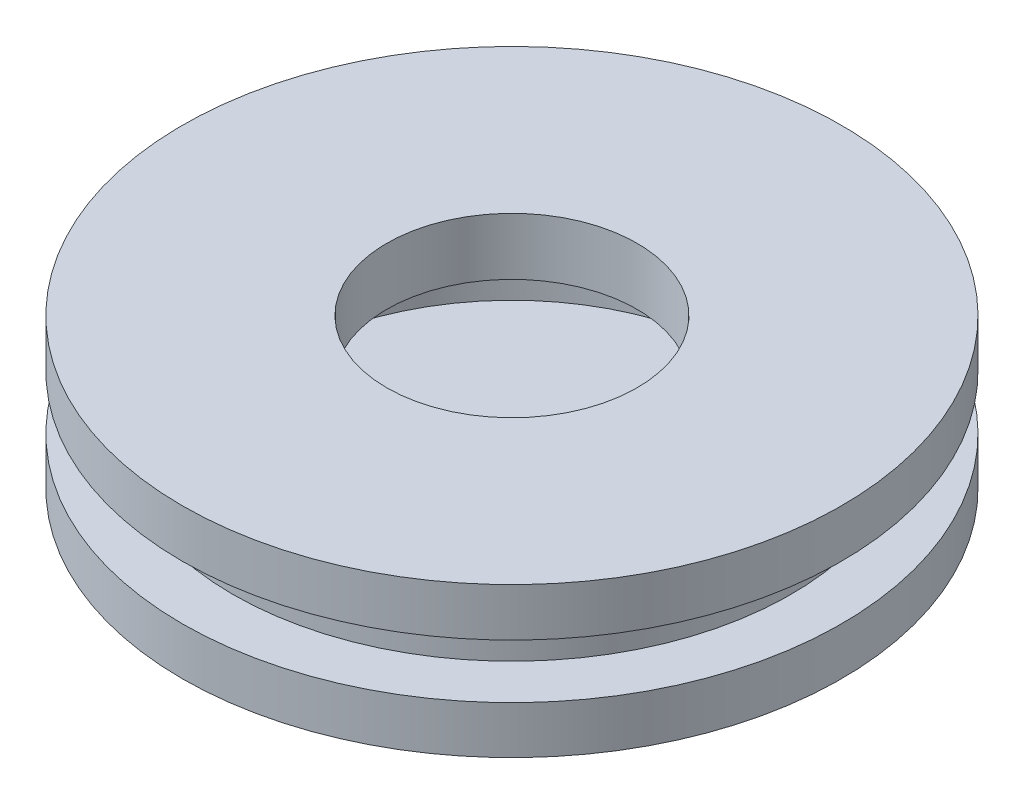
ISO-10303-21;
HEADER;
FILE_DESCRIPTION(('STEP AP214'),'2;1');
FILE_NAME('part.step','',(''),(''),'','','');
FILE_SCHEMA(('AUTOMOTIVE_DESIGN { 1 0 10303 214 1 1 1 1 }'));
ENDSEC;
DATA;
#1=APPLICATION_CONTEXT('core data for automotive mechanical design processes');
#2=APPLICATION_PROTOCOL_DEFINITION('international standard','automotive_design',2000,#1);
#3=PRODUCT_CONTEXT('',#1,'mechanical');
#4=PRODUCT('Part','Part','',(#3));
#5=PRODUCT_RELATED_PRODUCT_CATEGORY('part','',(#4));
#6=PRODUCT_DEFINITION_FORMATION('','',#4);
#7=PRODUCT_DEFINITION_CONTEXT('part definition',#1,'design');
#8=PRODUCT_DEFINITION('design','',#6,#7);
#9=PRODUCT_DEFINITION_SHAPE('','',#8);
#10=(LENGTH_UNIT() NAMED_UNIT(*) SI_UNIT(.MILLI.,.METRE.));
#11=(NAMED_UNIT(*) PLANE_ANGLE_UNIT() SI_UNIT($,.RADIAN.));
#12=(NAMED_UNIT(*) SI_UNIT($,.STERADIAN.) SOLID_ANGLE_UNIT());
#13=UNCERTAINTY_MEASURE_WITH_UNIT(LENGTH_MEASURE(1.E-05),#10,'distance_accuracy_value','');
#14=(GEOMETRIC_REPRESENTATION_CONTEXT(3) GLOBAL_UNCERTAINTY_ASSIGNED_CONTEXT((#13)) GLOBAL_UNIT_ASSIGNED_CONTEXT((#10,
#11,#12)) REPRESENTATION_CONTEXT('',''));
#15=CARTESIAN_POINT('',(0.,0.,0.));
#16=DIRECTION('',(0.,0.,1.));
#17=DIRECTION('',(1.,0.,0.));
#18=AXIS2_PLACEMENT_3D('',#15,#16,#17);
#19=CARTESIAN_POINT('',(0.,-2.95538243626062,0.));
#20=DIRECTION('',(0.,1.,0.));
#21=DIRECTION('',(0.,0.,1.));
#22=AXIS2_PLACEMENT_3D('',#19,#20,#21);
#23=CONICAL_SURFACE('',#22,6.5,1.36415687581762);
#24=CARTESIAN_POINT('',(0.,-4.31798866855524,0.));
#25=VERTEX_POINT('',#24);
#26=VERTEX_LOOP('',#25);
#27=FACE_BOUND('',#26,.T.);
#28=CARTESIAN_POINT('',(0.,-2.95538243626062,0.));
#29=DIRECTION('',(0.,1.,0.));
#30=DIRECTION('',(0.,0.,1.));
#31=AXIS2_PLACEMENT_3D('',#28,#29,#30);
#32=CIRCLE('',#31,6.5);
#33=CARTESIAN_POINT('',(0.,-2.95538243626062,6.5));
#34=VERTEX_POINT('',#33);
#35=EDGE_CURVE('E51',#34,#34,#32,.T.);
#36=ORIENTED_EDGE('',*,*,#35,.F.);
#37=EDGE_LOOP('',(#36));
#38=FACE_BOUND('',#37,.T.);
#39=ADVANCED_FACE('F36',(#27,#38),#23,.T.);
#40=CARTESIAN_POINT('',(0.,0.,0.));
#41=DIRECTION('',(0.,1.,0.));
#42=DIRECTION('',(0.,0.,1.));
#43=AXIS2_PLACEMENT_3D('',#40,#41,#42);
#44=PLANE('',#43);
#45=CARTESIAN_POINT('',(0.,0.,0.));
#46=DIRECTION('',(0.,1.,0.));
#47=DIRECTION('',(0.,0.,1.));
#48=AXIS2_PLACEMENT_3D('',#45,#46,#47);
#49=CIRCLE('',#48,2.46928204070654);
#50=CARTESIAN_POINT('',(0.,0.,2.46928204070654));
#51=VERTEX_POINT('',#50);
#52=EDGE_CURVE('E39',#51,#51,#49,.T.);
#53=ORIENTED_EDGE('',*,*,#52,.F.);
#54=EDGE_LOOP('',(#53));
#55=FACE_BOUND('',#54,.T.);
#56=CARTESIAN_POINT('',(0.,0.,0.));
#57=DIRECTION('',(0.,1.,0.));
#58=DIRECTION('',(0.,0.,1.));
#59=AXIS2_PLACEMENT_3D('',#56,#57,#58);
#60=CIRCLE('',#59,6.5);
#61=CARTESIAN_POINT('',(0.,0.,6.5));
#62=VERTEX_POINT('',#61);
#63=EDGE_CURVE('E11',#62,#62,#60,.T.);
#64=ORIENTED_EDGE('',*,*,#63,.T.);
#65=EDGE_LOOP('',(#64));
#66=FACE_BOUND('',#65,.T.);
#67=ADVANCED_FACE('F48',(#55,#66),#44,.T.);
#68=CARTESIAN_POINT('',(0.,-4.31798866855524,0.));
#69=DIRECTION('',(0.,1.,0.));
#70=DIRECTION('',(0.,0.,1.));
#71=AXIS2_PLACEMENT_3D('',#68,#69,#70);
#72=CYLINDRICAL_SURFACE('',#71,6.5);
#73=CARTESIAN_POINT('',(0.,-0.948300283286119,0.));
#74=DIRECTION('',(0.,1.,0.));
#75=DIRECTION('',(0.,0.,1.));
#76=AXIS2_PLACEMENT_3D('',#73,#74,#75);
#77=CIRCLE('',#76,6.5);
#78=CARTESIAN_POINT('',(0.,-0.948300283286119,6.5));
#79=VERTEX_POINT('',#78);
#80=EDGE_CURVE('E43',#79,#79,#77,.T.);
#81=ORIENTED_EDGE('',*,*,#80,.T.);
#82=EDGE_LOOP('',(#81));
#83=FACE_BOUND('',#82,.T.);
#84=ORIENTED_EDGE('',*,*,#63,.F.);
#85=EDGE_LOOP('',(#84));
#86=FACE_BOUND('',#85,.T.);
#87=ADVANCED_FACE('F71',(#83,#86),#72,.T.);
#88=CARTESIAN_POINT('',(-6.5,-0.94830028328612,0.));
#89=DIRECTION('',(0.,-1.,0.));
#90=DIRECTION('',(0.,0.,-1.));
#91=AXIS2_PLACEMENT_3D('',#88,#89,#90);
#92=PLANE('',#91);
#93=CARTESIAN_POINT('',(0.,-0.94830028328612,0.));
#94=DIRECTION('',(0.,1.,0.));
#95=DIRECTION('',(0.,0.,1.));
#96=AXIS2_PLACEMENT_3D('',#93,#94,#95);
#97=CIRCLE('',#96,5.5);
#98=CARTESIAN_POINT('',(0.,-0.94830028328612,5.5));
#99=VERTEX_POINT('',#98);
#100=EDGE_CURVE('E65',#99,#99,#97,.T.);
#101=ORIENTED_EDGE('',*,*,#100,.T.);
#102=EDGE_LOOP('',(#101));
#103=FACE_BOUND('',#102,.T.);
#104=ORIENTED_EDGE('',*,*,#80,.F.);
#105=EDGE_LOOP('',(#104));
#106=FACE_BOUND('',#105,.T.);
#107=ADVANCED_FACE('F74',(#103,#106),#92,.T.);
#108=CARTESIAN_POINT('',(0.,-4.31798866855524,0.));
#109=DIRECTION('',(0.,1.,0.));
#110=DIRECTION('',(0.,0.,1.));
#111=AXIS2_PLACEMENT_3D('',#108,#109,#110);
#112=CYLINDRICAL_SURFACE('',#111,5.5);
#113=CARTESIAN_POINT('',(0.,-2.01628895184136,0.));
#114=DIRECTION('',(0.,1.,0.));
#115=DIRECTION('',(0.,0.,1.));
#116=AXIS2_PLACEMENT_3D('',#113,#114,#115);
#117=CIRCLE('',#116,5.5);
#118=CARTESIAN_POINT('',(0.,-2.01628895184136,5.5));
#119=VERTEX_POINT('',#118);
#120=EDGE_CURVE('E56',#119,#119,#117,.T.);
#121=ORIENTED_EDGE('',*,*,#120,.T.);
#122=EDGE_LOOP('',(#121));
#123=FACE_BOUND('',#122,.T.);
#124=ORIENTED_EDGE('',*,*,#100,.F.);
#125=EDGE_LOOP('',(#124));
#126=FACE_BOUND('',#125,.T.);
#127=ADVANCED_FACE('F76',(#123,#126),#112,.T.);
#128=CARTESIAN_POINT('',(-5.5,-2.01628895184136,0.));
#129=DIRECTION('',(0.,1.,0.));
#130=DIRECTION('',(0.,0.,1.));
#131=AXIS2_PLACEMENT_3D('',#128,#129,#130);
#132=PLANE('',#131);
#133=CARTESIAN_POINT('',(0.,-2.01628895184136,0.));
#134=DIRECTION('',(0.,1.,0.));
#135=DIRECTION('',(0.,0.,1.));
#136=AXIS2_PLACEMENT_3D('',#133,#134,#135);
#137=CIRCLE('',#136,6.5);
#138=CARTESIAN_POINT('',(0.,-2.01628895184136,6.5));
#139=VERTEX_POINT('',#138);
#140=EDGE_CURVE('E53',#139,#139,#137,.T.);
#141=ORIENTED_EDGE('',*,*,#140,.T.);
#142=EDGE_LOOP('',(#141));
#143=FACE_BOUND('',#142,.T.);
#144=ORIENTED_EDGE('',*,*,#120,.F.);
#145=EDGE_LOOP('',(#144));
#146=FACE_BOUND('',#145,.T.);
#147=ADVANCED_FACE('F83',(#143,#146),#132,.T.);
#148=CARTESIAN_POINT('',(0.,-4.31798866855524,0.));
#149=DIRECTION('',(0.,1.,0.));
#150=DIRECTION('',(0.,0.,1.));
#151=AXIS2_PLACEMENT_3D('',#148,#149,#150);
#152=CYLINDRICAL_SURFACE('',#151,6.5);
#153=ORIENTED_EDGE('',*,*,#35,.T.);
#154=EDGE_LOOP('',(#153));
#155=FACE_BOUND('',#154,.T.);
#156=ORIENTED_EDGE('',*,*,#140,.F.);
#157=EDGE_LOOP('',(#156));
#158=FACE_BOUND('',#157,.T.);
#159=ADVANCED_FACE('F124',(#155,#158),#152,.T.);
#160=CARTESIAN_POINT('',(0.,-2.95538243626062,0.));
#161=DIRECTION('',(0.,-1.,0.));
#162=DIRECTION('',(0.,0.,-1.));
#163=AXIS2_PLACEMENT_3D('',#160,#161,#162);
#164=PLANE('',#163);
#165=CARTESIAN_POINT('',(0.,-2.95538243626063,0.));
#166=DIRECTION('',(0.,1.,0.));
#167=DIRECTION('',(0.,0.,1.));
#168=AXIS2_PLACEMENT_3D('',#165,#166,#167);
#169=CIRCLE('',#168,4.54867579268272);
#170=CARTESIAN_POINT('',(0.,-2.95538243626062,4.54867579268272));
#171=VERTEX_POINT('',#170);
#172=EDGE_CURVE('E59',#171,#171,#169,.T.);
#173=ORIENTED_EDGE('',*,*,#172,.T.);
#174=EDGE_LOOP('',(#173));
#175=FACE_BOUND('',#174,.T.);
#176=ADVANCED_FACE('F113',(#175),#164,.F.);
#177=CARTESIAN_POINT('',(0.,0.988040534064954,0.));
#178=DIRECTION('',(0.,1.,0.));
#179=DIRECTION('',(0.,0.,1.));
#180=AXIS2_PLACEMENT_3D('',#177,#178,#179);
#181=CYLINDRICAL_SURFACE('',#180,4.54867579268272);
#182=ORIENTED_EDGE('',*,*,#172,.F.);
#183=EDGE_LOOP('',(#182));
#184=FACE_BOUND('',#183,.T.);
#185=CARTESIAN_POINT('',(0.,-1.1276676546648,0.));
#186=DIRECTION('',(0.,1.,0.));
#187=DIRECTION('',(0.,0.,1.));
#188=AXIS2_PLACEMENT_3D('',#185,#186,#187);
#189=CIRCLE('',#188,4.54867579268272);
#190=CARTESIAN_POINT('',(0.,-1.1276676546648,4.54867579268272));
#191=VERTEX_POINT('',#190);
#192=EDGE_CURVE('E105',#191,#191,#189,.T.);
#193=ORIENTED_EDGE('',*,*,#192,.T.);
#194=EDGE_LOOP('',(#193));
#195=FACE_BOUND('',#194,.T.);
#196=ADVANCED_FACE('F115',(#184,#195),#181,.F.);
#197=CARTESIAN_POINT('',(0.,-1.1276676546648,4.54867579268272));
#198=DIRECTION('',(0.,1.,0.));
#199=DIRECTION('',(0.,0.,1.));
#200=AXIS2_PLACEMENT_3D('',#197,#198,#199);
#201=PLANE('',#200);
#202=ORIENTED_EDGE('',*,*,#192,.F.);
#203=EDGE_LOOP('',(#202));
#204=FACE_BOUND('',#203,.T.);
#205=CARTESIAN_POINT('',(0.,-1.1276676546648,0.));
#206=DIRECTION('',(0.,1.,0.));
#207=DIRECTION('',(0.,0.,1.));
#208=AXIS2_PLACEMENT_3D('',#205,#206,#207);
#209=CIRCLE('',#208,2.46928204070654);
#210=CARTESIAN_POINT('',(0.,-1.1276676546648,2.46928204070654));
#211=VERTEX_POINT('',#210);
#212=EDGE_CURVE('E103',#211,#211,#209,.T.);
#213=ORIENTED_EDGE('',*,*,#212,.T.);
#214=EDGE_LOOP('',(#213));
#215=FACE_BOUND('',#214,.T.);
#216=ADVANCED_FACE('F99',(#204,#215),#201,.F.);
#217=CARTESIAN_POINT('',(0.,0.988040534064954,0.));
#218=DIRECTION('',(0.,1.,0.));
#219=DIRECTION('',(0.,0.,1.));
#220=AXIS2_PLACEMENT_3D('',#217,#218,#219);
#221=CYLINDRICAL_SURFACE('',#220,2.46928204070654);
#222=ORIENTED_EDGE('',*,*,#52,.T.);
#223=EDGE_LOOP('',(#222));
#224=FACE_BOUND('',#223,.T.);
#225=ORIENTED_EDGE('',*,*,#212,.F.);
#226=EDGE_LOOP('',(#225));
#227=FACE_BOUND('',#226,.T.);
#228=ADVANCED_FACE('F96',(#224,#227),#221,.F.);
#229=CLOSED_SHELL('',(#39,#67,#87,#107,#127,#147,#159,#176,#196,#216,#228));
#230=MANIFOLD_SOLID_BREP('B2',#229);
#231=ADVANCED_BREP_SHAPE_REPRESENTATION('',(#18,#230),#14);
#232=SHAPE_DEFINITION_REPRESENTATION(#9,#231);
ENDSEC;
END-ISO-10303-21;
